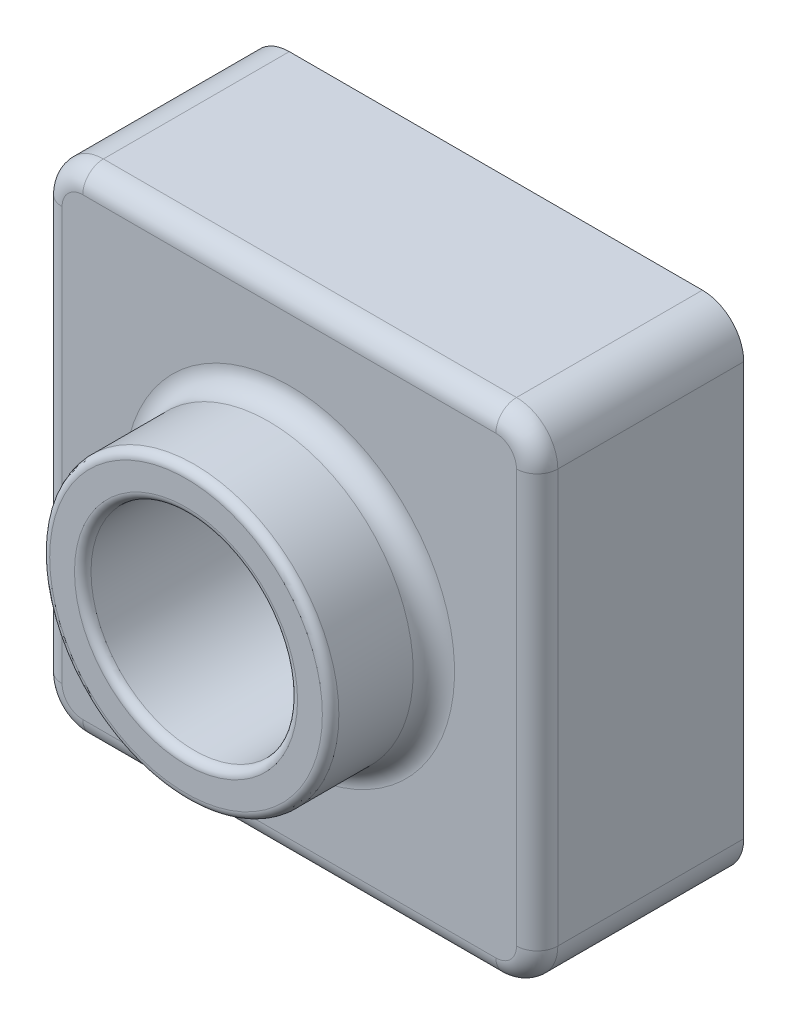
from build123d import *

# Parameters (mm, degrees)
SKETCH1_W          = 120
SKETCH1_H          = 120
BOX_DEPTH          = 50
SKETCH2_R          = 35
KNOB_DEPTH         = 25
SKETCH3_R          = 25
HOLE_IN_KNOB_DEPTH = 186.539753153
OUTSIDE_CORNERS_R  = 10
FILLET2_R          = 5
FILLET3_R          = 2
SHELL1_T           = -4


with BuildPart() as part:
    # Sketch1 → Box (new body)
    with BuildSketch(Plane.XY):
        with Locations((60, 60)):
            Rectangle(SKETCH1_W, SKETCH1_H)
    extrude(amount=-BOX_DEPTH)

    # Sketch2 → Knob (add)
    with BuildSketch(Plane.XY):
        with Locations(Location((60, 60, 0), (0, 0, 180))):
            Circle(SKETCH2_R)
    extrude(amount=KNOB_DEPTH)

    # Sketch3 → Hole_in_knob (cut, through all)
    with BuildSketch(Plane.XY.offset(25)):
        with Locations((60, 60)):
            Circle(SKETCH3_R)
    extrude(amount=-HOLE_IN_KNOB_DEPTH, mode=Mode.SUBTRACT)

    # Outside_corners
    outside_corners_edges = [part.edges().sort_by_distance(p)[0] for p in [
        (0, 120, -25),
        (120, 120, -25),
        (120, 0, -25),
        (0, 0, -25),
    ]]
    fillet(outside_corners_edges, radius=OUTSIDE_CORNERS_R)

    # Fillet2
    fillet2_edges = [part.edges().sort_by_distance(p)[0] for p in [
        (95, 60, 0),
        (120, 60, 0),
        (0, 60, 0),
        (60, 0, 0),
        (60, 120, 0),
        (2.928932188, 2.928932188, 0),
        (117.071067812, 2.928932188, 0),
        (2.928932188, 117.071067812, 0),
        (117.071067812, 117.071067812, 0),
    ]]
    fillet(fillet2_edges, radius=FILLET2_R)

    # Fillet3
    fillet3_edges = [part.edges().sort_by_distance(p)[0] for p in [
        (95, 60, 25),
        (35, 60, 25),
    ]]
    fillet(fillet3_edges, radius=FILLET3_R)

    # Shell1
    shell1_openings = [part.faces().sort_by_distance(p)[0] for p in [
        (60, 1.697056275, -50),
    ]]
    offset(amount=SHELL1_T, openings=shell1_openings, kind=Kind.INTERSECTION)


solid = part.part
